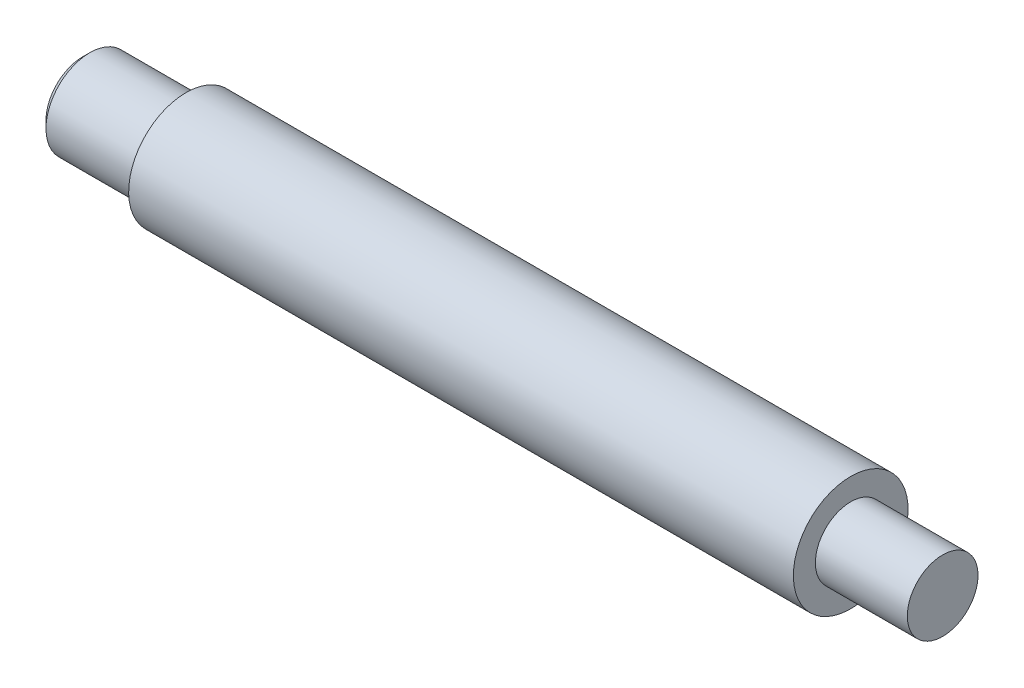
from build123d import *


with BuildPart() as part:
    # Sketch1 → Revolve1 (revolve)
    with BuildSketch(Plane.XY, mode=Mode.PRIVATE) as revolve1_sk:
        Polygon((60.8, 0), (60.8, -2.5), (54.3, -2.5), (54.3, -4.055), (7.3, -4.055), (7.3, -3.1), (0.5, -3.1), (0, -2.6), (0, 0), align=None)
    revolve(revolve1_sk.sketch.rotate(Axis((60.8, 0, 0), (-1, 0, 0)), 180), axis=Axis((60.8, 0, 0), (-1, 0, 0)))


solid = part.part
